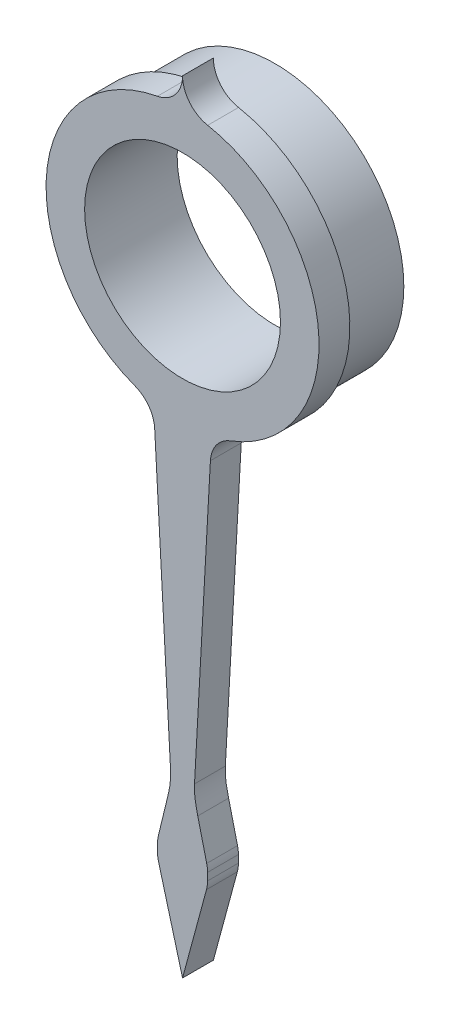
from build123d import *
from build123d.topology import SkipClean

# Parameters (mm, degrees)
SKETCH_1_R      = 3.175
EXTRUDE_1_DEPTH = 1
EXTRUDE_START   = 2
SKETCH_2_R      = 4.175
SKETCH_2_R_2    = 3.175
EXTRUDE_2_DEPTH = 2


with BuildPart() as part:
    # Sketch 1 → Extrude 1 (new body)
    with BuildSketch(Plane.XY):
        with BuildLine():
            Line((0.8114, -8.753580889), (0.8114, -8.994697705))
            ThreePointArc((0.8114, -8.994697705), (0.802683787, -9.126441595), (0.776687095, -9.25588887))
            Line((0.776687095, -9.25588887), (0, -12.1263))
            Line((0, -12.1263), (-0.776687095, -9.25588887))
            ThreePointArc((-0.776687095, -9.25588887), (-0.802683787, -9.126441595), (-0.8114, -8.994697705))
            Line((-0.8114, -8.994697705), (-0.8114, -8.753580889))
            ThreePointArc((-0.8114, -8.753580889), (-0.804290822, -8.634552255), (-0.783064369, -8.517216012))
            Line((-0.783064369, -8.517216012), (-0.4939, -7.3285))
            add(Edge.make_bspline(
                [(-0.4939, -7.3285), (-0.424635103, -7.04376128), (-0.371058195, -6.790542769), (-0.3881, -6.4818)],
                knots=[0, 0, 0, 0, 1, 1, 1, 1], degree=3))
            Line((-0.3881, -6.4818), (-0.903227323, 2.850652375))
            ThreePointArc((-0.903227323, 2.850652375), (-1.095979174, 3.387824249), (-1.551162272, 3.732084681))
            ThreePointArc((-1.551162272, 3.732084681), (-4.408501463, 8.258058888), (-0.815668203, 12.225473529))
            ThreePointArc((-0.815668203, 12.225473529), (-0.230476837, 12.569718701), (0, 13.208337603))
            ThreePointArc((0, 13.208337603), (0.230476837, 12.569718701), (0.815668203, 12.225473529))
            ThreePointArc((0.815668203, 12.225473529), (4.408501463, 8.258058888), (1.551162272, 3.732084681))
            ThreePointArc((1.551162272, 3.732084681), (1.095979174, 3.387824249), (0.903227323, 2.850652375))
            Line((0.903227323, 2.850652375), (0.3881, -6.4818))
            add(Edge.make_bspline(
                [(0.4939, -7.3285), (0.424635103, -7.04376128), (0.371058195, -6.790542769), (0.3881, -6.4818)],
                knots=[0, 0, 0, 0, 1, 1, 1, 1], degree=3))
            Line((0.4939, -7.3285), (0.783064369, -8.517216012))
            ThreePointArc((0.783064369, -8.517216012), (0.804290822, -8.634552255), (0.8114, -8.753580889))
        make_face()
        with Locations((0, 7.8763)):
            Circle(SKETCH_1_R, mode=Mode.SUBTRACT)
    extrude(amount=EXTRUDE_1_DEPTH)

    # Sketch 2 → Extrude 2 (add)
    with SkipClean():  # the faces are left unmerged after this step: merging them gives an invalid solid
        with BuildSketch(Plane(origin=(0, 0, 0), x_dir=(-1, 0, 0), z_dir=(0, 0, -1)).offset(EXTRUDE_START)):
            with Locations((0, 7.8763)):
                Circle(SKETCH_2_R)
            with Locations((0, 7.8763)):
                Circle(SKETCH_2_R_2, mode=Mode.SUBTRACT)
        extrude(amount=-EXTRUDE_2_DEPTH)


solid = part.part
